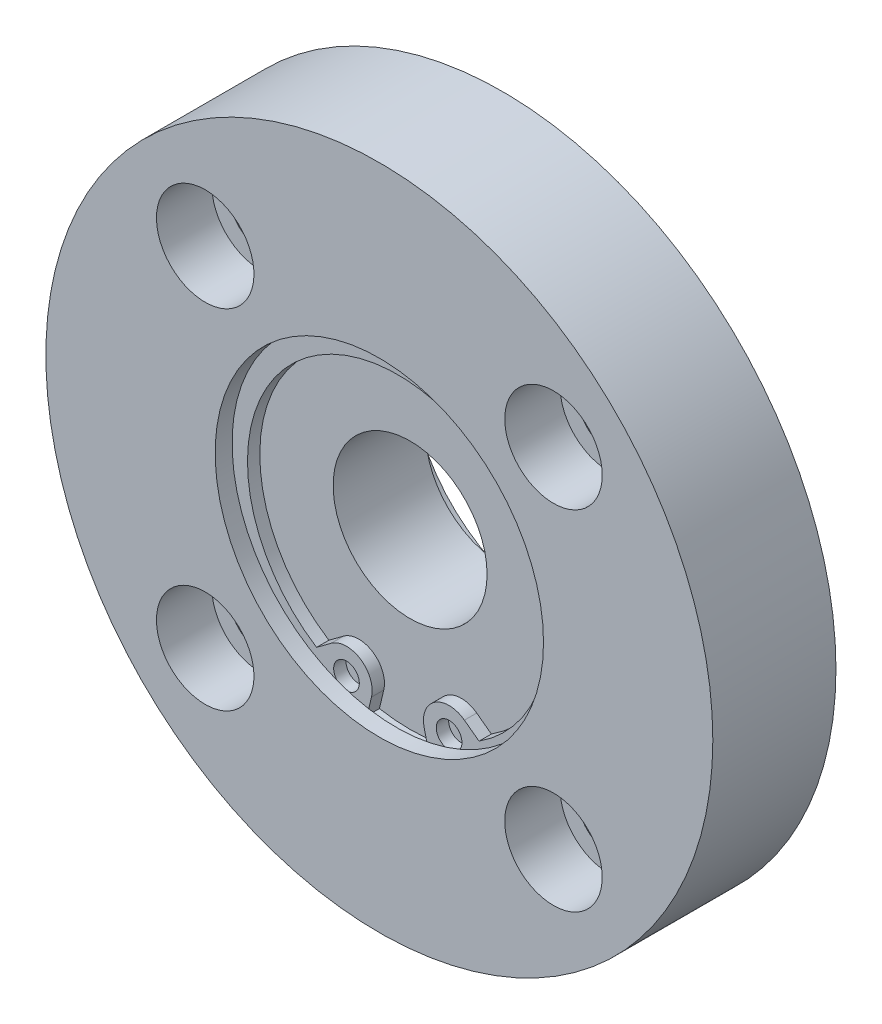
ISO-10303-21;
HEADER;
FILE_DESCRIPTION(('STEP AP214'),'2;1');
FILE_NAME('part.step','',(''),(''),'','','');
FILE_SCHEMA(('AUTOMOTIVE_DESIGN { 1 0 10303 214 1 1 1 1 }'));
ENDSEC;
DATA;
#1=APPLICATION_CONTEXT('core data for automotive mechanical design processes');
#2=APPLICATION_PROTOCOL_DEFINITION('international standard','automotive_design',2000,#1);
#3=PRODUCT_CONTEXT('',#1,'mechanical');
#4=PRODUCT('Part','Part','',(#3));
#5=PRODUCT_RELATED_PRODUCT_CATEGORY('part','',(#4));
#6=PRODUCT_DEFINITION_FORMATION('','',#4);
#7=PRODUCT_DEFINITION_CONTEXT('part definition',#1,'design');
#8=PRODUCT_DEFINITION('design','',#6,#7);
#9=PRODUCT_DEFINITION_SHAPE('','',#8);
#10=(LENGTH_UNIT() NAMED_UNIT(*) SI_UNIT(.MILLI.,.METRE.));
#11=(NAMED_UNIT(*) PLANE_ANGLE_UNIT() SI_UNIT($,.RADIAN.));
#12=(NAMED_UNIT(*) SI_UNIT($,.STERADIAN.) SOLID_ANGLE_UNIT());
#13=UNCERTAINTY_MEASURE_WITH_UNIT(LENGTH_MEASURE(1.E-05),#10,'distance_accuracy_value','');
#14=(GEOMETRIC_REPRESENTATION_CONTEXT(3) GLOBAL_UNCERTAINTY_ASSIGNED_CONTEXT((#13)) GLOBAL_UNIT_ASSIGNED_CONTEXT((#10,
#11,#12)) REPRESENTATION_CONTEXT('',''));
#15=CARTESIAN_POINT('',(0.,0.,0.));
#16=DIRECTION('',(0.,0.,1.));
#17=DIRECTION('',(1.,0.,0.));
#18=AXIS2_PLACEMENT_3D('',#15,#16,#17);
#19=CARTESIAN_POINT('',(16.9705627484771,16.9705627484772,0.));
#20=DIRECTION('',(0.,0.,1.));
#21=DIRECTION('',(1.,0.,0.));
#22=AXIS2_PLACEMENT_3D('',#19,#20,#21);
#23=CYLINDRICAL_SURFACE('',#22,3.);
#24=CARTESIAN_POINT('',(16.9705627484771,16.9705627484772,0.));
#25=DIRECTION('',(0.,0.,1.));
#26=DIRECTION('',(1.,0.,0.));
#27=AXIS2_PLACEMENT_3D('',#24,#25,#26);
#28=CIRCLE('',#27,3.);
#29=CARTESIAN_POINT('',(19.970562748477,16.9705627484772,0.));
#30=VERTEX_POINT('',#29);
#31=EDGE_CURVE('E226',#30,#30,#28,.T.);
#32=ORIENTED_EDGE('',*,*,#31,.F.);
#33=EDGE_LOOP('',(#32));
#34=FACE_BOUND('',#33,.T.);
#35=CARTESIAN_POINT('',(16.9705627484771,16.9705627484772,6.6));
#36=DIRECTION('',(0.,0.,1.));
#37=DIRECTION('',(1.,0.,0.));
#38=AXIS2_PLACEMENT_3D('',#35,#36,#37);
#39=CIRCLE('',#38,3.);
#40=CARTESIAN_POINT('',(19.970562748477,16.9705627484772,6.6));
#41=VERTEX_POINT('',#40);
#42=EDGE_CURVE('E225',#41,#41,#39,.F.);
#43=ORIENTED_EDGE('',*,*,#42,.F.);
#44=EDGE_LOOP('',(#43));
#45=FACE_BOUND('',#44,.T.);
#46=ADVANCED_FACE('F14',(#34,#45),#23,.F.);
#47=CARTESIAN_POINT('',(16.9705627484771,-16.9705627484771,0.));
#48=DIRECTION('',(0.,0.,1.));
#49=DIRECTION('',(1.,0.,0.));
#50=AXIS2_PLACEMENT_3D('',#47,#48,#49);
#51=CYLINDRICAL_SURFACE('',#50,3.);
#52=CARTESIAN_POINT('',(16.9705627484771,-16.9705627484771,0.));
#53=DIRECTION('',(0.,0.,1.));
#54=DIRECTION('',(0.,-1.,0.));
#55=AXIS2_PLACEMENT_3D('',#52,#53,#54);
#56=CIRCLE('',#55,3.);
#57=CARTESIAN_POINT('',(16.9705627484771,-19.9705627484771,0.));
#58=VERTEX_POINT('',#57);
#59=EDGE_CURVE('E216',#58,#58,#56,.T.);
#60=ORIENTED_EDGE('',*,*,#59,.F.);
#61=EDGE_LOOP('',(#60));
#62=FACE_BOUND('',#61,.T.);
#63=CARTESIAN_POINT('',(16.9705627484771,-16.9705627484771,6.6));
#64=DIRECTION('',(0.,0.,1.));
#65=DIRECTION('',(1.,0.,0.));
#66=AXIS2_PLACEMENT_3D('',#63,#64,#65);
#67=CIRCLE('',#66,3.);
#68=CARTESIAN_POINT('',(19.9705627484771,-16.9705627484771,6.6));
#69=VERTEX_POINT('',#68);
#70=EDGE_CURVE('E209',#69,#69,#67,.F.);
#71=ORIENTED_EDGE('',*,*,#70,.F.);
#72=EDGE_LOOP('',(#71));
#73=FACE_BOUND('',#72,.T.);
#74=ADVANCED_FACE('F326',(#62,#73),#51,.F.);
#75=CARTESIAN_POINT('',(-16.9705627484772,-16.9705627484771,0.));
#76=DIRECTION('',(0.,0.,1.));
#77=DIRECTION('',(1.,0.,0.));
#78=AXIS2_PLACEMENT_3D('',#75,#76,#77);
#79=CYLINDRICAL_SURFACE('',#78,3.);
#80=CARTESIAN_POINT('',(-16.9705627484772,-16.9705627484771,0.));
#81=DIRECTION('',(0.,0.,1.));
#82=DIRECTION('',(-1.,0.,0.));
#83=AXIS2_PLACEMENT_3D('',#80,#81,#82);
#84=CIRCLE('',#83,3.);
#85=CARTESIAN_POINT('',(-19.9705627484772,-16.9705627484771,0.));
#86=VERTEX_POINT('',#85);
#87=EDGE_CURVE('E213',#86,#86,#84,.T.);
#88=ORIENTED_EDGE('',*,*,#87,.F.);
#89=EDGE_LOOP('',(#88));
#90=FACE_BOUND('',#89,.T.);
#91=CARTESIAN_POINT('',(-16.9705627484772,-16.9705627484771,6.6));
#92=DIRECTION('',(0.,0.,1.));
#93=DIRECTION('',(1.,0.,0.));
#94=AXIS2_PLACEMENT_3D('',#91,#92,#93);
#95=CIRCLE('',#94,3.);
#96=CARTESIAN_POINT('',(-13.9705627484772,-16.9705627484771,6.6));
#97=VERTEX_POINT('',#96);
#98=EDGE_CURVE('E202',#97,#97,#95,.F.);
#99=ORIENTED_EDGE('',*,*,#98,.F.);
#100=EDGE_LOOP('',(#99));
#101=FACE_BOUND('',#100,.T.);
#102=ADVANCED_FACE('F332',(#90,#101),#79,.F.);
#103=CARTESIAN_POINT('',(-16.9705627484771,16.9705627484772,0.));
#104=DIRECTION('',(0.,0.,1.));
#105=DIRECTION('',(1.,0.,0.));
#106=AXIS2_PLACEMENT_3D('',#103,#104,#105);
#107=CYLINDRICAL_SURFACE('',#106,3.);
#108=CARTESIAN_POINT('',(-16.9705627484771,16.9705627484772,0.));
#109=DIRECTION('',(0.,0.,1.));
#110=DIRECTION('',(0.,1.,0.));
#111=AXIS2_PLACEMENT_3D('',#108,#109,#110);
#112=CIRCLE('',#111,3.);
#113=CARTESIAN_POINT('',(-16.970562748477,19.9705627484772,0.));
#114=VERTEX_POINT('',#113);
#115=EDGE_CURVE('E210',#114,#114,#112,.T.);
#116=ORIENTED_EDGE('',*,*,#115,.F.);
#117=EDGE_LOOP('',(#116));
#118=FACE_BOUND('',#117,.T.);
#119=CARTESIAN_POINT('',(-16.9705627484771,16.9705627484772,6.6));
#120=DIRECTION('',(0.,0.,1.));
#121=DIRECTION('',(1.,0.,0.));
#122=AXIS2_PLACEMENT_3D('',#119,#120,#121);
#123=CIRCLE('',#122,3.);
#124=CARTESIAN_POINT('',(-13.9705627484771,16.9705627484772,6.6));
#125=VERTEX_POINT('',#124);
#126=EDGE_CURVE('E195',#125,#125,#123,.F.);
#127=ORIENTED_EDGE('',*,*,#126,.F.);
#128=EDGE_LOOP('',(#127));
#129=FACE_BOUND('',#128,.T.);
#130=ADVANCED_FACE('F474',(#118,#129),#107,.F.);
#131=CARTESIAN_POINT('',(0.,0.,-5.));
#132=DIRECTION('',(0.,0.,1.));
#133=DIRECTION('',(1.,0.,0.));
#134=AXIS2_PLACEMENT_3D('',#131,#132,#133);
#135=CYLINDRICAL_SURFACE('',#134,19.);
#136=CARTESIAN_POINT('',(0.,0.,-5.));
#137=DIRECTION('',(0.,0.,-1.));
#138=DIRECTION('',(-1.,0.,0.));
#139=AXIS2_PLACEMENT_3D('',#136,#137,#138);
#140=CIRCLE('',#139,19.);
#141=CARTESIAN_POINT('',(-19.,0.,-5.));
#142=VERTEX_POINT('',#141);
#143=EDGE_CURVE('E177',#142,#142,#140,.T.);
#144=ORIENTED_EDGE('',*,*,#143,.F.);
#145=EDGE_LOOP('',(#144));
#146=FACE_BOUND('',#145,.T.);
#147=CARTESIAN_POINT('',(0.,0.,0.));
#148=DIRECTION('',(0.,0.,-1.));
#149=DIRECTION('',(-1.,0.,0.));
#150=AXIS2_PLACEMENT_3D('',#147,#148,#149);
#151=CIRCLE('',#150,19.);
#152=CARTESIAN_POINT('',(-19.,0.,0.));
#153=VERTEX_POINT('',#152);
#154=EDGE_CURVE('E178',#153,#153,#151,.T.);
#155=ORIENTED_EDGE('',*,*,#154,.T.);
#156=EDGE_LOOP('',(#155));
#157=FACE_BOUND('',#156,.T.);
#158=ADVANCED_FACE('F469',(#146,#157),#135,.T.);
#159=CARTESIAN_POINT('',(0.,0.,0.));
#160=DIRECTION('',(0.,0.,1.));
#161=DIRECTION('',(1.,0.,0.));
#162=AXIS2_PLACEMENT_3D('',#159,#160,#161);
#163=PLANE('',#162);
#164=ORIENTED_EDGE('',*,*,#115,.T.);
#165=EDGE_LOOP('',(#164));
#166=FACE_BOUND('',#165,.T.);
#167=ORIENTED_EDGE('',*,*,#87,.T.);
#168=EDGE_LOOP('',(#167));
#169=FACE_BOUND('',#168,.T.);
#170=ORIENTED_EDGE('',*,*,#59,.T.);
#171=EDGE_LOOP('',(#170));
#172=FACE_BOUND('',#171,.T.);
#173=ORIENTED_EDGE('',*,*,#31,.T.);
#174=EDGE_LOOP('',(#173));
#175=FACE_BOUND('',#174,.T.);
#176=CARTESIAN_POINT('',(0.,0.,0.));
#177=DIRECTION('',(0.,0.,1.));
#178=DIRECTION('',(1.,0.,0.));
#179=AXIS2_PLACEMENT_3D('',#176,#177,#178);
#180=CIRCLE('',#179,32.5);
#181=CARTESIAN_POINT('',(32.5,0.,0.));
#182=VERTEX_POINT('',#181);
#183=EDGE_CURVE('E232',#182,#182,#180,.T.);
#184=ORIENTED_EDGE('',*,*,#183,.F.);
#185=EDGE_LOOP('',(#184));
#186=FACE_BOUND('',#185,.T.);
#187=ORIENTED_EDGE('',*,*,#154,.F.);
#188=EDGE_LOOP('',(#187));
#189=FACE_BOUND('',#188,.T.);
#190=ADVANCED_FACE('F351',(#166,#169,#172,#175,#186,#189),#163,.F.);
#191=CARTESIAN_POINT('',(16.9705627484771,16.9705627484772,6.6));
#192=DIRECTION('',(0.,0.,1.));
#193=DIRECTION('',(1.,0.,0.));
#194=AXIS2_PLACEMENT_3D('',#191,#192,#193);
#195=PLANE('',#194);
#196=CARTESIAN_POINT('',(16.9705627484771,16.9705627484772,6.6));
#197=DIRECTION('',(0.,0.,1.));
#198=DIRECTION('',(1.,0.,0.));
#199=AXIS2_PLACEMENT_3D('',#196,#197,#198);
#200=CIRCLE('',#199,4.75);
#201=CARTESIAN_POINT('',(21.7205627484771,16.9705627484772,6.6));
#202=VERTEX_POINT('',#201);
#203=EDGE_CURVE('E222',#202,#202,#200,.T.);
#204=ORIENTED_EDGE('',*,*,#203,.T.);
#205=EDGE_LOOP('',(#204));
#206=FACE_BOUND('',#205,.T.);
#207=ORIENTED_EDGE('',*,*,#42,.T.);
#208=EDGE_LOOP('',(#207));
#209=FACE_BOUND('',#208,.T.);
#210=ADVANCED_FACE('F553',(#206,#209),#195,.T.);
#211=CARTESIAN_POINT('',(16.9705627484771,-16.9705627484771,6.6));
#212=DIRECTION('',(0.,0.,1.));
#213=DIRECTION('',(0.,-1.,0.));
#214=AXIS2_PLACEMENT_3D('',#211,#212,#213);
#215=PLANE('',#214);
#216=CARTESIAN_POINT('',(16.9705627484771,-16.9705627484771,6.6));
#217=DIRECTION('',(0.,0.,1.));
#218=DIRECTION('',(0.,-1.,0.));
#219=AXIS2_PLACEMENT_3D('',#216,#217,#218);
#220=CIRCLE('',#219,4.75);
#221=CARTESIAN_POINT('',(16.9705627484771,-21.7205627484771,6.6));
#222=VERTEX_POINT('',#221);
#223=EDGE_CURVE('E206',#222,#222,#220,.T.);
#224=ORIENTED_EDGE('',*,*,#223,.T.);
#225=EDGE_LOOP('',(#224));
#226=FACE_BOUND('',#225,.T.);
#227=ORIENTED_EDGE('',*,*,#70,.T.);
#228=EDGE_LOOP('',(#227));
#229=FACE_BOUND('',#228,.T.);
#230=ADVANCED_FACE('F514',(#226,#229),#215,.T.);
#231=CARTESIAN_POINT('',(-16.9705627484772,-16.9705627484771,6.6));
#232=DIRECTION('',(0.,0.,1.));
#233=DIRECTION('',(-1.,0.,0.));
#234=AXIS2_PLACEMENT_3D('',#231,#232,#233);
#235=PLANE('',#234);
#236=CARTESIAN_POINT('',(-16.9705627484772,-16.9705627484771,6.6));
#237=DIRECTION('',(0.,0.,1.));
#238=DIRECTION('',(-1.,0.,0.));
#239=AXIS2_PLACEMENT_3D('',#236,#237,#238);
#240=CIRCLE('',#239,4.75);
#241=CARTESIAN_POINT('',(-21.7205627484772,-16.9705627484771,6.6));
#242=VERTEX_POINT('',#241);
#243=EDGE_CURVE('E199',#242,#242,#240,.T.);
#244=ORIENTED_EDGE('',*,*,#243,.T.);
#245=EDGE_LOOP('',(#244));
#246=FACE_BOUND('',#245,.T.);
#247=ORIENTED_EDGE('',*,*,#98,.T.);
#248=EDGE_LOOP('',(#247));
#249=FACE_BOUND('',#248,.T.);
#250=ADVANCED_FACE('F493',(#246,#249),#235,.T.);
#251=CARTESIAN_POINT('',(-16.9705627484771,16.9705627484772,6.6));
#252=DIRECTION('',(0.,0.,1.));
#253=DIRECTION('',(0.,1.,0.));
#254=AXIS2_PLACEMENT_3D('',#251,#252,#253);
#255=PLANE('',#254);
#256=CARTESIAN_POINT('',(-16.9705627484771,16.9705627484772,6.6));
#257=DIRECTION('',(0.,0.,1.));
#258=DIRECTION('',(0.,1.,0.));
#259=AXIS2_PLACEMENT_3D('',#256,#257,#258);
#260=CIRCLE('',#259,4.75);
#261=CARTESIAN_POINT('',(-16.970562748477,21.7205627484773,6.6));
#262=VERTEX_POINT('',#261);
#263=EDGE_CURVE('E192',#262,#262,#260,.T.);
#264=ORIENTED_EDGE('',*,*,#263,.T.);
#265=EDGE_LOOP('',(#264));
#266=FACE_BOUND('',#265,.T.);
#267=ORIENTED_EDGE('',*,*,#126,.T.);
#268=EDGE_LOOP('',(#267));
#269=FACE_BOUND('',#268,.T.);
#270=ADVANCED_FACE('F462',(#266,#269),#255,.T.);
#271=CARTESIAN_POINT('',(0.,0.,-5.));
#272=DIRECTION('',(0.,0.,-1.));
#273=DIRECTION('',(-1.,0.,0.));
#274=AXIS2_PLACEMENT_3D('',#271,#272,#273);
#275=PLANE('',#274);
#276=ORIENTED_EDGE('',*,*,#143,.T.);
#277=EDGE_LOOP('',(#276));
#278=FACE_BOUND('',#277,.T.);
#279=CARTESIAN_POINT('',(0.,0.,-5.));
#280=DIRECTION('',(0.,0.,-1.));
#281=DIRECTION('',(-1.,0.,0.));
#282=AXIS2_PLACEMENT_3D('',#279,#280,#281);
#283=CIRCLE('',#282,14.);
#284=CARTESIAN_POINT('',(-14.,0.,-5.));
#285=VERTEX_POINT('',#284);
#286=EDGE_CURVE('E174',#285,#285,#283,.T.);
#287=ORIENTED_EDGE('',*,*,#286,.F.);
#288=EDGE_LOOP('',(#287));
#289=FACE_BOUND('',#288,.T.);
#290=ADVANCED_FACE('F359',(#278,#289),#275,.T.);
#291=CARTESIAN_POINT('',(0.,0.,12.));
#292=DIRECTION('',(0.,0.,-1.));
#293=DIRECTION('',(-1.,0.,0.));
#294=AXIS2_PLACEMENT_3D('',#291,#292,#293);
#295=CYLINDRICAL_SURFACE('',#294,32.5);
#296=CARTESIAN_POINT('',(0.,0.,12.));
#297=DIRECTION('',(0.,0.,1.));
#298=DIRECTION('',(1.,0.,0.));
#299=AXIS2_PLACEMENT_3D('',#296,#297,#298);
#300=CIRCLE('',#299,32.5);
#301=CARTESIAN_POINT('',(32.5,0.,12.));
#302=VERTEX_POINT('',#301);
#303=EDGE_CURVE('E182',#302,#302,#300,.T.);
#304=ORIENTED_EDGE('',*,*,#303,.F.);
#305=EDGE_LOOP('',(#304));
#306=FACE_BOUND('',#305,.T.);
#307=ORIENTED_EDGE('',*,*,#183,.T.);
#308=EDGE_LOOP('',(#307));
#309=FACE_BOUND('',#308,.T.);
#310=ADVANCED_FACE('F356',(#306,#309),#295,.T.);
#311=CARTESIAN_POINT('',(16.9705627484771,16.9705627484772,6.6));
#312=DIRECTION('',(0.,0.,1.));
#313=DIRECTION('',(1.,0.,0.));
#314=AXIS2_PLACEMENT_3D('',#311,#312,#313);
#315=CYLINDRICAL_SURFACE('',#314,4.75);
#316=ORIENTED_EDGE('',*,*,#203,.F.);
#317=EDGE_LOOP('',(#316));
#318=FACE_BOUND('',#317,.T.);
#319=CARTESIAN_POINT('',(16.9705627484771,16.9705627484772,12.));
#320=DIRECTION('',(0.,0.,1.));
#321=DIRECTION('',(1.,0.,0.));
#322=AXIS2_PLACEMENT_3D('',#319,#320,#321);
#323=CIRCLE('',#322,4.75);
#324=CARTESIAN_POINT('',(21.7205627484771,16.9705627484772,12.));
#325=VERTEX_POINT('',#324);
#326=EDGE_CURVE('E219',#325,#325,#323,.T.);
#327=ORIENTED_EDGE('',*,*,#326,.T.);
#328=EDGE_LOOP('',(#327));
#329=FACE_BOUND('',#328,.T.);
#330=ADVANCED_FACE('F339',(#318,#329),#315,.F.);
#331=CARTESIAN_POINT('',(16.9705627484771,-16.9705627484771,6.6));
#332=DIRECTION('',(0.,0.,1.));
#333=DIRECTION('',(1.,0.,0.));
#334=AXIS2_PLACEMENT_3D('',#331,#332,#333);
#335=CYLINDRICAL_SURFACE('',#334,4.75);
#336=ORIENTED_EDGE('',*,*,#223,.F.);
#337=EDGE_LOOP('',(#336));
#338=FACE_BOUND('',#337,.T.);
#339=CARTESIAN_POINT('',(16.9705627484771,-16.9705627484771,12.));
#340=DIRECTION('',(0.,0.,1.));
#341=DIRECTION('',(0.,-1.,0.));
#342=AXIS2_PLACEMENT_3D('',#339,#340,#341);
#343=CIRCLE('',#342,4.75);
#344=CARTESIAN_POINT('',(16.9705627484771,-21.7205627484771,12.));
#345=VERTEX_POINT('',#344);
#346=EDGE_CURVE('E203',#345,#345,#343,.T.);
#347=ORIENTED_EDGE('',*,*,#346,.T.);
#348=EDGE_LOOP('',(#347));
#349=FACE_BOUND('',#348,.T.);
#350=ADVANCED_FACE('F523',(#338,#349),#335,.F.);
#351=CARTESIAN_POINT('',(-16.9705627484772,-16.9705627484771,6.6));
#352=DIRECTION('',(0.,0.,1.));
#353=DIRECTION('',(1.,0.,0.));
#354=AXIS2_PLACEMENT_3D('',#351,#352,#353);
#355=CYLINDRICAL_SURFACE('',#354,4.75);
#356=ORIENTED_EDGE('',*,*,#243,.F.);
#357=EDGE_LOOP('',(#356));
#358=FACE_BOUND('',#357,.T.);
#359=CARTESIAN_POINT('',(-16.9705627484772,-16.9705627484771,12.));
#360=DIRECTION('',(0.,0.,1.));
#361=DIRECTION('',(-1.,0.,0.));
#362=AXIS2_PLACEMENT_3D('',#359,#360,#361);
#363=CIRCLE('',#362,4.75);
#364=CARTESIAN_POINT('',(-21.7205627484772,-16.9705627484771,12.));
#365=VERTEX_POINT('',#364);
#366=EDGE_CURVE('E196',#365,#365,#363,.T.);
#367=ORIENTED_EDGE('',*,*,#366,.T.);
#368=EDGE_LOOP('',(#367));
#369=FACE_BOUND('',#368,.T.);
#370=ADVANCED_FACE('F504',(#358,#369),#355,.F.);
#371=CARTESIAN_POINT('',(-16.9705627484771,16.9705627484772,6.6));
#372=DIRECTION('',(0.,0.,1.));
#373=DIRECTION('',(1.,0.,0.));
#374=AXIS2_PLACEMENT_3D('',#371,#372,#373);
#375=CYLINDRICAL_SURFACE('',#374,4.75);
#376=ORIENTED_EDGE('',*,*,#263,.F.);
#377=EDGE_LOOP('',(#376));
#378=FACE_BOUND('',#377,.T.);
#379=CARTESIAN_POINT('',(-16.9705627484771,16.9705627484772,12.));
#380=DIRECTION('',(0.,0.,1.));
#381=DIRECTION('',(0.,1.,0.));
#382=AXIS2_PLACEMENT_3D('',#379,#380,#381);
#383=CIRCLE('',#382,4.75);
#384=CARTESIAN_POINT('',(-16.970562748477,21.7205627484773,12.));
#385=VERTEX_POINT('',#384);
#386=EDGE_CURVE('E189',#385,#385,#383,.T.);
#387=ORIENTED_EDGE('',*,*,#386,.T.);
#388=EDGE_LOOP('',(#387));
#389=FACE_BOUND('',#388,.T.);
#390=ADVANCED_FACE('F499',(#378,#389),#375,.F.);
#391=CARTESIAN_POINT('',(0.,0.,-5.));
#392=DIRECTION('',(0.,0.,1.));
#393=DIRECTION('',(1.,0.,0.));
#394=AXIS2_PLACEMENT_3D('',#391,#392,#393);
#395=CYLINDRICAL_SURFACE('',#394,14.);
#396=ORIENTED_EDGE('',*,*,#286,.T.);
#397=EDGE_LOOP('',(#396));
#398=FACE_BOUND('',#397,.T.);
#399=CARTESIAN_POINT('',(0.,0.,0.));
#400=DIRECTION('',(0.,0.,-1.));
#401=DIRECTION('',(-1.,0.,0.));
#402=AXIS2_PLACEMENT_3D('',#399,#400,#401);
#403=CIRCLE('',#402,14.);
#404=CARTESIAN_POINT('',(-14.,0.,0.));
#405=VERTEX_POINT('',#404);
#406=EDGE_CURVE('E171',#405,#405,#403,.T.);
#407=ORIENTED_EDGE('',*,*,#406,.F.);
#408=EDGE_LOOP('',(#407));
#409=FACE_BOUND('',#408,.T.);
#410=ADVANCED_FACE('F354',(#398,#409),#395,.F.);
#411=CARTESIAN_POINT('',(0.,0.,12.));
#412=DIRECTION('',(0.,0.,1.));
#413=DIRECTION('',(1.,0.,0.));
#414=AXIS2_PLACEMENT_3D('',#411,#412,#413);
#415=PLANE('',#414);
#416=CARTESIAN_POINT('',(0.,0.,12.));
#417=DIRECTION('',(0.,0.,1.));
#418=DIRECTION('',(1.,0.,0.));
#419=AXIS2_PLACEMENT_3D('',#416,#417,#418);
#420=CIRCLE('',#419,16.);
#421=CARTESIAN_POINT('',(16.,0.,12.));
#422=VERTEX_POINT('',#421);
#423=EDGE_CURVE('E185',#422,#422,#420,.T.);
#424=ORIENTED_EDGE('',*,*,#423,.F.);
#425=EDGE_LOOP('',(#424));
#426=FACE_BOUND('',#425,.T.);
#427=ORIENTED_EDGE('',*,*,#386,.F.);
#428=EDGE_LOOP('',(#427));
#429=FACE_BOUND('',#428,.T.);
#430=ORIENTED_EDGE('',*,*,#366,.F.);
#431=EDGE_LOOP('',(#430));
#432=FACE_BOUND('',#431,.T.);
#433=ORIENTED_EDGE('',*,*,#346,.F.);
#434=EDGE_LOOP('',(#433));
#435=FACE_BOUND('',#434,.T.);
#436=ORIENTED_EDGE('',*,*,#326,.F.);
#437=EDGE_LOOP('',(#436));
#438=FACE_BOUND('',#437,.T.);
#439=ORIENTED_EDGE('',*,*,#303,.T.);
#440=EDGE_LOOP('',(#439));
#441=FACE_BOUND('',#440,.T.);
#442=ADVANCED_FACE('F349',(#426,#429,#432,#435,#438,#441),#415,.T.);
#443=ORIENTED_EDGE('',*,*,#406,.T.);
#444=EDGE_LOOP('',(#443));
#445=FACE_BOUND('',#444,.T.);
#446=CARTESIAN_POINT('',(0.,0.,0.));
#447=DIRECTION('',(0.,0.,1.));
#448=DIRECTION('',(1.,0.,0.));
#449=AXIS2_PLACEMENT_3D('',#446,#447,#448);
#450=CIRCLE('',#449,7.5);
#451=CARTESIAN_POINT('',(7.5,0.,0.));
#452=VERTEX_POINT('',#451);
#453=EDGE_CURVE('E229',#452,#452,#450,.T.);
#454=ORIENTED_EDGE('',*,*,#453,.T.);
#455=EDGE_LOOP('',(#454));
#456=FACE_BOUND('',#455,.T.);
#457=ADVANCED_FACE('F346',(#445,#456),#163,.F.);
#458=CARTESIAN_POINT('',(0.,0.,9.));
#459=DIRECTION('',(0.,0.,1.));
#460=DIRECTION('',(1.,0.,0.));
#461=AXIS2_PLACEMENT_3D('',#458,#459,#460);
#462=CYLINDRICAL_SURFACE('',#461,16.);
#463=CARTESIAN_POINT('',(0.,0.,10.35));
#464=DIRECTION('',(0.,0.,1.));
#465=DIRECTION('',(1.,0.,0.));
#466=AXIS2_PLACEMENT_3D('',#463,#464,#465);
#467=CIRCLE('',#466,16.);
#468=CARTESIAN_POINT('',(16.,0.,10.35));
#469=VERTEX_POINT('',#468);
#470=EDGE_CURVE('E168',#469,#469,#467,.F.);
#471=ORIENTED_EDGE('',*,*,#470,.T.);
#472=EDGE_LOOP('',(#471));
#473=FACE_BOUND('',#472,.T.);
#474=ORIENTED_EDGE('',*,*,#423,.T.);
#475=EDGE_LOOP('',(#474));
#476=FACE_BOUND('',#475,.T.);
#477=ADVANCED_FACE('F344',(#473,#476),#462,.F.);
#478=CARTESIAN_POINT('',(0.,0.,12.));
#479=DIRECTION('',(0.,0.,-1.));
#480=DIRECTION('',(-1.,0.,0.));
#481=AXIS2_PLACEMENT_3D('',#478,#479,#480);
#482=CYLINDRICAL_SURFACE('',#481,7.5);
#483=ORIENTED_EDGE('',*,*,#453,.F.);
#484=EDGE_LOOP('',(#483));
#485=FACE_BOUND('',#484,.T.);
#486=CARTESIAN_POINT('',(0.,0.,9.));
#487=DIRECTION('',(0.,0.,1.));
#488=DIRECTION('',(1.,0.,0.));
#489=AXIS2_PLACEMENT_3D('',#486,#487,#488);
#490=CIRCLE('',#489,7.5);
#491=CARTESIAN_POINT('',(7.5,0.,9.));
#492=VERTEX_POINT('',#491);
#493=EDGE_CURVE('E188',#492,#492,#490,.T.);
#494=ORIENTED_EDGE('',*,*,#493,.T.);
#495=EDGE_LOOP('',(#494));
#496=FACE_BOUND('',#495,.T.);
#497=ADVANCED_FACE('F341',(#485,#496),#482,.F.);
#498=CARTESIAN_POINT('',(0.,0.,9.));
#499=DIRECTION('',(0.,0.,1.));
#500=DIRECTION('',(1.,0.,0.));
#501=AXIS2_PLACEMENT_3D('',#498,#499,#500);
#502=PLANE('',#501);
#503=ORIENTED_EDGE('',*,*,#493,.F.);
#504=EDGE_LOOP('',(#503));
#505=FACE_BOUND('',#504,.T.);
#506=CARTESIAN_POINT('',(0.,0.,9.));
#507=DIRECTION('',(0.,0.,1.));
#508=DIRECTION('',(1.,0.,0.));
#509=AXIS2_PLACEMENT_3D('',#506,#507,#508);
#510=CIRCLE('',#509,16.85);
#511=CARTESIAN_POINT('',(-2.99125499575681,-16.5823669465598,9.));
#512=VERTEX_POINT('',#511);
#513=CARTESIAN_POINT('',(2.99125499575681,-16.5823669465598,9.));
#514=VERTEX_POINT('',#513);
#515=EDGE_CURVE('E153',#512,#514,#510,.T.);
#516=ORIENTED_EDGE('',*,*,#515,.T.);
#517=DIRECTION('',(-0.231349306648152,0.972870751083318,0.));
#518=VECTOR('',#517,1.);
#519=CARTESIAN_POINT('',(-0.901087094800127,-0.214279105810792,9.));
#520=LINE('',#519,#518);
#521=CARTESIAN_POINT('',(2.56782312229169,-14.8017500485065,9.));
#522=VERTEX_POINT('',#521);
#523=EDGE_CURVE('E9',#514,#522,#520,.T.);
#524=ORIENTED_EDGE('',*,*,#523,.T.);
#525=CARTESIAN_POINT('',(5.,-14.2233767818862,9.));
#526=DIRECTION('',(0.,0.,1.));
#527=DIRECTION('',(1.,0.,0.));
#528=AXIS2_PLACEMENT_3D('',#525,#526,#527);
#529=CIRCLE('',#528,2.5);
#530=CARTESIAN_POINT('',(6.49138441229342,-12.2169439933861,9.));
#531=VERTEX_POINT('',#530);
#532=EDGE_CURVE('E25',#531,#522,#529,.T.);
#533=ORIENTED_EDGE('',*,*,#532,.F.);
#534=DIRECTION('',(0.802573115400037,-0.596553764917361,0.));
#535=VECTOR('',#534,1.);
#536=CARTESIAN_POINT('',(-3.53907369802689,-4.76128987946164,9.));
#537=LINE('',#536,#535);
#538=CARTESIAN_POINT('',(7.91695293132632,-13.2765711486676,9.));
#539=VERTEX_POINT('',#538);
#540=EDGE_CURVE('E72',#531,#539,#537,.T.);
#541=ORIENTED_EDGE('',*,*,#540,.T.);
#542=CARTESIAN_POINT('',(0.,-0.95,9.));
#543=DIRECTION('',(0.,0.,1.));
#544=DIRECTION('',(1.,0.,0.));
#545=AXIS2_PLACEMENT_3D('',#542,#543,#544);
#546=CIRCLE('',#545,14.65);
#547=CARTESIAN_POINT('',(-7.91695293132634,-13.2765711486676,9.));
#548=VERTEX_POINT('',#547);
#549=EDGE_CURVE('E274',#539,#548,#546,.T.);
#550=ORIENTED_EDGE('',*,*,#549,.T.);
#551=DIRECTION('',(0.802573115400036,0.596553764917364,0.));
#552=VECTOR('',#551,1.);
#553=CARTESIAN_POINT('',(3.53907369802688,-4.7612898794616,9.));
#554=LINE('',#553,#552);
#555=CARTESIAN_POINT('',(-6.49138441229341,-12.2169439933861,9.));
#556=VERTEX_POINT('',#555);
#557=EDGE_CURVE('E270',#548,#556,#554,.T.);
#558=ORIENTED_EDGE('',*,*,#557,.T.);
#559=CARTESIAN_POINT('',(-5.,-14.2233767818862,9.));
#560=DIRECTION('',(0.,0.,1.));
#561=DIRECTION('',(1.,0.,0.));
#562=AXIS2_PLACEMENT_3D('',#559,#560,#561);
#563=CIRCLE('',#562,2.5);
#564=CARTESIAN_POINT('',(-2.56782312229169,-14.8017500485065,9.));
#565=VERTEX_POINT('',#564);
#566=EDGE_CURVE('E265',#565,#556,#563,.T.);
#567=ORIENTED_EDGE('',*,*,#566,.F.);
#568=DIRECTION('',(-0.231349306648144,-0.97287075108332,0.));
#569=VECTOR('',#568,1.);
#570=CARTESIAN_POINT('',(0.901087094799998,-0.214279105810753,9.));
#571=LINE('',#570,#569);
#572=EDGE_CURVE('E268',#565,#512,#571,.T.);
#573=ORIENTED_EDGE('',*,*,#572,.T.);
#574=EDGE_LOOP('',(#516,#524,#533,#541,#550,#558,#567,#573));
#575=FACE_BOUND('',#574,.T.);
#576=ADVANCED_FACE('F309',(#505,#575),#502,.T.);
#577=CARTESIAN_POINT('',(0.,0.,10.35));
#578=DIRECTION('',(0.,0.,1.));
#579=DIRECTION('',(1.,0.,0.));
#580=AXIS2_PLACEMENT_3D('',#577,#578,#579);
#581=PLANE('',#580);
#582=CARTESIAN_POINT('',(0.,0.,10.35));
#583=DIRECTION('',(0.,0.,1.));
#584=DIRECTION('',(1.,0.,0.));
#585=AXIS2_PLACEMENT_3D('',#582,#583,#584);
#586=CIRCLE('',#585,16.85);
#587=CARTESIAN_POINT('',(16.85,0.,10.35));
#588=VERTEX_POINT('',#587);
#589=EDGE_CURVE('E161',#588,#588,#586,.T.);
#590=ORIENTED_EDGE('',*,*,#589,.F.);
#591=EDGE_LOOP('',(#590));
#592=FACE_BOUND('',#591,.T.);
#593=ORIENTED_EDGE('',*,*,#470,.F.);
#594=EDGE_LOOP('',(#593));
#595=FACE_BOUND('',#594,.T.);
#596=ADVANCED_FACE('F444',(#592,#595),#581,.F.);
#597=CARTESIAN_POINT('',(0.,0.,10.35));
#598=DIRECTION('',(0.,0.,-1.));
#599=DIRECTION('',(-1.,0.,0.));
#600=AXIS2_PLACEMENT_3D('',#597,#598,#599);
#601=CYLINDRICAL_SURFACE('',#600,16.85);
#602=ORIENTED_EDGE('',*,*,#589,.T.);
#603=EDGE_LOOP('',(#602));
#604=FACE_BOUND('',#603,.T.);
#605=CARTESIAN_POINT('',(0.,0.,10.2));
#606=DIRECTION('',(0.,0.,-1.));
#607=DIRECTION('',(-1.,0.,0.));
#608=AXIS2_PLACEMENT_3D('',#605,#606,#607);
#609=CIRCLE('',#608,16.85);
#610=CARTESIAN_POINT('',(-2.99125499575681,-16.5823669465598,10.2));
#611=VERTEX_POINT('',#610);
#612=CARTESIAN_POINT('',(2.99125499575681,-16.5823669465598,10.2));
#613=VERTEX_POINT('',#612);
#614=EDGE_CURVE('E251',#611,#613,#609,.T.);
#615=ORIENTED_EDGE('',*,*,#614,.T.);
#616=DIRECTION('',(0.,0.,-1.));
#617=VECTOR('',#616,1.);
#618=CARTESIAN_POINT('',(2.99125499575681,-16.5823669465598,10.35));
#619=LINE('',#618,#617);
#620=EDGE_CURVE('E254',#613,#514,#619,.T.);
#621=ORIENTED_EDGE('',*,*,#620,.T.);
#622=ORIENTED_EDGE('',*,*,#515,.F.);
#623=DIRECTION('',(0.,0.,-1.));
#624=VECTOR('',#623,1.);
#625=CARTESIAN_POINT('',(-2.99125499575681,-16.5823669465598,10.35));
#626=LINE('',#625,#624);
#627=EDGE_CURVE('E181',#512,#611,#626,.F.);
#628=ORIENTED_EDGE('',*,*,#627,.T.);
#629=EDGE_LOOP('',(#615,#621,#622,#628));
#630=FACE_BOUND('',#629,.T.);
#631=ADVANCED_FACE('F310',(#604,#630),#601,.F.);
#632=CARTESIAN_POINT('',(5.,-14.2233767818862,9.));
#633=DIRECTION('',(0.,0.,1.));
#634=DIRECTION('',(1.,0.,0.));
#635=AXIS2_PLACEMENT_3D('',#632,#633,#634);
#636=CIRCLE('',#635,1.25);
#637=CARTESIAN_POINT('',(6.25,-14.2233767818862,9.));
#638=VERTEX_POINT('',#637);
#639=EDGE_CURVE('E257',#638,#638,#636,.T.);
#640=ORIENTED_EDGE('',*,*,#639,.T.);
#641=EDGE_LOOP('',(#640));
#642=FACE_BOUND('',#641,.T.);
#643=ADVANCED_FACE('F375',(#642),#502,.T.);
#644=CARTESIAN_POINT('',(-5.,-14.2233767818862,9.));
#645=DIRECTION('',(0.,0.,1.));
#646=DIRECTION('',(1.,0.,0.));
#647=AXIS2_PLACEMENT_3D('',#644,#645,#646);
#648=CIRCLE('',#647,1.25);
#649=CARTESIAN_POINT('',(-3.75,-14.2233767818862,9.));
#650=VERTEX_POINT('',#649);
#651=EDGE_CURVE('E261',#650,#650,#648,.T.);
#652=ORIENTED_EDGE('',*,*,#651,.T.);
#653=EDGE_LOOP('',(#652));
#654=FACE_BOUND('',#653,.T.);
#655=ADVANCED_FACE('F322',(#654),#502,.T.);
#656=CARTESIAN_POINT('',(6.49138441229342,-12.2169439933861,10.2));
#657=DIRECTION('',(-0.596553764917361,-0.802573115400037,0.));
#658=DIRECTION('',(-0.802573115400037,0.596553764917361,0.));
#659=AXIS2_PLACEMENT_3D('',#656,#657,#658);
#660=PLANE('',#659);
#661=ORIENTED_EDGE('',*,*,#540,.F.);
#662=DIRECTION('',(0.,0.,-1.));
#663=VECTOR('',#662,1.);
#664=CARTESIAN_POINT('',(6.49138441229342,-12.2169439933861,10.2));
#665=LINE('',#664,#663);
#666=CARTESIAN_POINT('',(6.49138441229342,-12.2169439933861,10.2));
#667=VERTEX_POINT('',#666);
#668=EDGE_CURVE('E66',#667,#531,#665,.T.);
#669=ORIENTED_EDGE('',*,*,#668,.F.);
#670=DIRECTION('',(-0.802573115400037,0.596553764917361,0.));
#671=VECTOR('',#670,1.);
#672=CARTESIAN_POINT('',(6.49138441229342,-12.2169439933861,10.2));
#673=LINE('',#672,#671);
#674=CARTESIAN_POINT('',(7.91695293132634,-13.2765711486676,10.2));
#675=VERTEX_POINT('',#674);
#676=EDGE_CURVE('E70',#675,#667,#673,.T.);
#677=ORIENTED_EDGE('',*,*,#676,.F.);
#678=DIRECTION('',(0.,0.,-1.));
#679=VECTOR('',#678,1.);
#680=CARTESIAN_POINT('',(7.91695293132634,-13.2765711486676,10.2));
#681=LINE('',#680,#679);
#682=EDGE_CURVE('E120',#675,#539,#681,.T.);
#683=ORIENTED_EDGE('',*,*,#682,.T.);
#684=EDGE_LOOP('',(#661,#669,#677,#683));
#685=FACE_BOUND('',#684,.T.);
#686=ADVANCED_FACE('F68',(#685),#660,.F.);
#687=CARTESIAN_POINT('',(0.,-0.95,10.2));
#688=DIRECTION('',(0.,0.,1.));
#689=DIRECTION('',(-1.,0.,0.));
#690=AXIS2_PLACEMENT_3D('',#687,#688,#689);
#691=CYLINDRICAL_SURFACE('',#690,14.65);
#692=ORIENTED_EDGE('',*,*,#549,.F.);
#693=ORIENTED_EDGE('',*,*,#682,.F.);
#694=CARTESIAN_POINT('',(0.,-0.95,10.2));
#695=DIRECTION('',(0.,0.,-1.));
#696=DIRECTION('',(0.,-1.,0.));
#697=AXIS2_PLACEMENT_3D('',#694,#695,#696);
#698=CIRCLE('',#697,14.65);
#699=CARTESIAN_POINT('',(-7.91695293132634,-13.2765711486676,10.2));
#700=VERTEX_POINT('',#699);
#701=EDGE_CURVE('E84',#700,#675,#698,.T.);
#702=ORIENTED_EDGE('',*,*,#701,.F.);
#703=DIRECTION('',(0.,0.,-1.));
#704=VECTOR('',#703,1.);
#705=CARTESIAN_POINT('',(-7.91695293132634,-13.2765711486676,10.2));
#706=LINE('',#705,#704);
#707=EDGE_CURVE('E122',#700,#548,#706,.T.);
#708=ORIENTED_EDGE('',*,*,#707,.T.);
#709=EDGE_LOOP('',(#692,#693,#702,#708));
#710=FACE_BOUND('',#709,.T.);
#711=ADVANCED_FACE('F312',(#710),#691,.F.);
#712=CARTESIAN_POINT('',(-6.49138441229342,-12.2169439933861,10.2));
#713=DIRECTION('',(0.596553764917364,-0.802573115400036,0.));
#714=DIRECTION('',(0.,0.,-1.));
#715=AXIS2_PLACEMENT_3D('',#712,#713,#714);
#716=PLANE('',#715);
#717=ORIENTED_EDGE('',*,*,#557,.F.);
#718=ORIENTED_EDGE('',*,*,#707,.F.);
#719=DIRECTION('',(-0.802573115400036,-0.596553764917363,0.));
#720=VECTOR('',#719,1.);
#721=CARTESIAN_POINT('',(-6.49138441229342,-12.2169439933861,10.2));
#722=LINE('',#721,#720);
#723=CARTESIAN_POINT('',(-6.49138441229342,-12.2169439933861,10.2));
#724=VERTEX_POINT('',#723);
#725=EDGE_CURVE('E123',#724,#700,#722,.T.);
#726=ORIENTED_EDGE('',*,*,#725,.F.);
#727=DIRECTION('',(0.,0.,-1.));
#728=VECTOR('',#727,1.);
#729=CARTESIAN_POINT('',(-6.49138441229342,-12.2169439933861,10.2));
#730=LINE('',#729,#728);
#731=EDGE_CURVE('E102',#724,#556,#730,.T.);
#732=ORIENTED_EDGE('',*,*,#731,.T.);
#733=EDGE_LOOP('',(#717,#718,#726,#732));
#734=FACE_BOUND('',#733,.T.);
#735=ADVANCED_FACE('F314',(#734),#716,.F.);
#736=CARTESIAN_POINT('',(-5.,-14.2233767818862,10.2));
#737=DIRECTION('',(0.,0.,1.));
#738=DIRECTION('',(-1.,0.,0.));
#739=AXIS2_PLACEMENT_3D('',#736,#737,#738);
#740=CYLINDRICAL_SURFACE('',#739,1.25);
#741=ORIENTED_EDGE('',*,*,#651,.F.);
#742=EDGE_LOOP('',(#741));
#743=FACE_BOUND('',#742,.T.);
#744=CARTESIAN_POINT('',(-5.,-14.2233767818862,10.2));
#745=DIRECTION('',(0.,0.,-1.));
#746=DIRECTION('',(1.,0.,0.));
#747=AXIS2_PLACEMENT_3D('',#744,#745,#746);
#748=CIRCLE('',#747,1.25);
#749=CARTESIAN_POINT('',(-3.75,-14.2233767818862,10.2));
#750=VERTEX_POINT('',#749);
#751=EDGE_CURVE('E75',#750,#750,#748,.T.);
#752=ORIENTED_EDGE('',*,*,#751,.F.);
#753=EDGE_LOOP('',(#752));
#754=FACE_BOUND('',#753,.T.);
#755=ADVANCED_FACE('F320',(#743,#754),#740,.F.);
#756=CARTESIAN_POINT('',(5.,-14.2233767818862,10.2));
#757=DIRECTION('',(0.,0.,1.));
#758=DIRECTION('',(-1.,0.,0.));
#759=AXIS2_PLACEMENT_3D('',#756,#757,#758);
#760=CYLINDRICAL_SURFACE('',#759,1.25);
#761=ORIENTED_EDGE('',*,*,#639,.F.);
#762=EDGE_LOOP('',(#761));
#763=FACE_BOUND('',#762,.T.);
#764=CARTESIAN_POINT('',(5.,-14.2233767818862,10.2));
#765=DIRECTION('',(0.,0.,1.));
#766=DIRECTION('',(1.,0.,0.));
#767=AXIS2_PLACEMENT_3D('',#764,#765,#766);
#768=CIRCLE('',#767,1.25);
#769=CARTESIAN_POINT('',(6.25,-14.2233767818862,10.2));
#770=VERTEX_POINT('',#769);
#771=EDGE_CURVE('E115',#770,#770,#768,.T.);
#772=ORIENTED_EDGE('',*,*,#771,.T.);
#773=EDGE_LOOP('',(#772));
#774=FACE_BOUND('',#773,.T.);
#775=ADVANCED_FACE('F362',(#763,#774),#760,.F.);
#776=CARTESIAN_POINT('',(5.,-14.2233767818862,10.2));
#777=DIRECTION('',(0.,0.,1.));
#778=DIRECTION('',(-1.,0.,0.));
#779=AXIS2_PLACEMENT_3D('',#776,#777,#778);
#780=CYLINDRICAL_SURFACE('',#779,2.5);
#781=ORIENTED_EDGE('',*,*,#532,.T.);
#782=DIRECTION('',(0.,0.,-1.));
#783=VECTOR('',#782,1.);
#784=CARTESIAN_POINT('',(2.5678231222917,-14.8017500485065,10.2));
#785=LINE('',#784,#783);
#786=CARTESIAN_POINT('',(2.5678231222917,-14.8017500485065,10.2));
#787=VERTEX_POINT('',#786);
#788=EDGE_CURVE('E76',#787,#522,#785,.T.);
#789=ORIENTED_EDGE('',*,*,#788,.F.);
#790=CARTESIAN_POINT('',(5.,-14.2233767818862,10.2));
#791=DIRECTION('',(0.,0.,1.));
#792=DIRECTION('',(1.,0.,0.));
#793=AXIS2_PLACEMENT_3D('',#790,#791,#792);
#794=CIRCLE('',#793,2.5);
#795=EDGE_CURVE('E18',#667,#787,#794,.T.);
#796=ORIENTED_EDGE('',*,*,#795,.F.);
#797=ORIENTED_EDGE('',*,*,#668,.T.);
#798=EDGE_LOOP('',(#781,#789,#796,#797));
#799=FACE_BOUND('',#798,.T.);
#800=ADVANCED_FACE('F16',(#799),#780,.T.);
#801=CARTESIAN_POINT('',(0.,-0.95,10.2));
#802=DIRECTION('',(0.,0.,-1.));
#803=DIRECTION('',(0.,-1.,0.));
#804=AXIS2_PLACEMENT_3D('',#801,#802,#803);
#805=PLANE('',#804);
#806=ORIENTED_EDGE('',*,*,#771,.F.);
#807=EDGE_LOOP('',(#806));
#808=FACE_BOUND('',#807,.T.);
#809=ORIENTED_EDGE('',*,*,#751,.T.);
#810=EDGE_LOOP('',(#809));
#811=FACE_BOUND('',#810,.T.);
#812=ORIENTED_EDGE('',*,*,#614,.F.);
#813=DIRECTION('',(0.231349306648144,0.97287075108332,0.));
#814=VECTOR('',#813,1.);
#815=CARTESIAN_POINT('',(-2.56782312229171,-14.8017500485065,10.2));
#816=LINE('',#815,#814);
#817=CARTESIAN_POINT('',(-2.56782312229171,-14.8017500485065,10.2));
#818=VERTEX_POINT('',#817);
#819=EDGE_CURVE('E93',#611,#818,#816,.T.);
#820=ORIENTED_EDGE('',*,*,#819,.T.);
#821=CARTESIAN_POINT('',(-5.,-14.2233767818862,10.2));
#822=DIRECTION('',(0.,0.,1.));
#823=DIRECTION('',(-1.,0.,0.));
#824=AXIS2_PLACEMENT_3D('',#821,#822,#823);
#825=CIRCLE('',#824,2.5);
#826=EDGE_CURVE('E99',#818,#724,#825,.T.);
#827=ORIENTED_EDGE('',*,*,#826,.T.);
#828=ORIENTED_EDGE('',*,*,#725,.T.);
#829=ORIENTED_EDGE('',*,*,#701,.T.);
#830=ORIENTED_EDGE('',*,*,#676,.T.);
#831=ORIENTED_EDGE('',*,*,#795,.T.);
#832=DIRECTION('',(0.231349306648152,-0.972870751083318,0.));
#833=VECTOR('',#832,1.);
#834=CARTESIAN_POINT('',(2.5678231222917,-14.8017500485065,10.2));
#835=LINE('',#834,#833);
#836=EDGE_CURVE('E90',#787,#613,#835,.T.);
#837=ORIENTED_EDGE('',*,*,#836,.T.);
#838=EDGE_LOOP('',(#812,#820,#827,#828,#829,#830,#831,#837));
#839=FACE_BOUND('',#838,.T.);
#840=ADVANCED_FACE('F81',(#808,#811,#839),#805,.F.);
#841=CARTESIAN_POINT('',(-5.,-14.2233767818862,10.2));
#842=DIRECTION('',(0.,0.,1.));
#843=DIRECTION('',(-1.,0.,0.));
#844=AXIS2_PLACEMENT_3D('',#841,#842,#843);
#845=CYLINDRICAL_SURFACE('',#844,2.5);
#846=ORIENTED_EDGE('',*,*,#566,.T.);
#847=ORIENTED_EDGE('',*,*,#731,.F.);
#848=ORIENTED_EDGE('',*,*,#826,.F.);
#849=DIRECTION('',(0.,0.,-1.));
#850=VECTOR('',#849,1.);
#851=CARTESIAN_POINT('',(-2.56782312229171,-14.8017500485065,10.2));
#852=LINE('',#851,#850);
#853=EDGE_CURVE('E119',#818,#565,#852,.T.);
#854=ORIENTED_EDGE('',*,*,#853,.T.);
#855=EDGE_LOOP('',(#846,#847,#848,#854));
#856=FACE_BOUND('',#855,.T.);
#857=ADVANCED_FACE('F364',(#856),#845,.T.);
#858=CARTESIAN_POINT('',(-2.56782312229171,-14.8017500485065,10.2));
#859=DIRECTION('',(-0.97287075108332,0.231349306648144,0.));
#860=DIRECTION('',(0.,0.,1.));
#861=AXIS2_PLACEMENT_3D('',#858,#859,#860);
#862=PLANE('',#861);
#863=ORIENTED_EDGE('',*,*,#627,.F.);
#864=ORIENTED_EDGE('',*,*,#572,.F.);
#865=ORIENTED_EDGE('',*,*,#853,.F.);
#866=ORIENTED_EDGE('',*,*,#819,.F.);
#867=EDGE_LOOP('',(#863,#864,#865,#866));
#868=FACE_BOUND('',#867,.T.);
#869=ADVANCED_FACE('F307',(#868),#862,.F.);
#870=CARTESIAN_POINT('',(2.5678231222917,-14.8017500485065,10.2));
#871=DIRECTION('',(0.972870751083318,0.231349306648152,0.));
#872=DIRECTION('',(0.,0.,-1.));
#873=AXIS2_PLACEMENT_3D('',#870,#871,#872);
#874=PLANE('',#873);
#875=ORIENTED_EDGE('',*,*,#620,.F.);
#876=ORIENTED_EDGE('',*,*,#836,.F.);
#877=ORIENTED_EDGE('',*,*,#788,.T.);
#878=ORIENTED_EDGE('',*,*,#523,.F.);
#879=EDGE_LOOP('',(#875,#876,#877,#878));
#880=FACE_BOUND('',#879,.T.);
#881=ADVANCED_FACE('F311',(#880),#874,.F.);
#882=CLOSED_SHELL('',(#46,#74,#102,#130,#158,#190,#210,#230,#250,#270,#290,#310,#330,#350,#370,
#390,#410,#442,#457,#477,#497,#576,#596,#631,#643,#655,#686,#711,#735,#755,#775,#800,#840,#857,
#869,#881));
#883=MANIFOLD_SOLID_BREP('B1',#882);
#884=ADVANCED_BREP_SHAPE_REPRESENTATION('',(#18,#883),#14);
#885=SHAPE_DEFINITION_REPRESENTATION(#9,#884);
ENDSEC;
END-ISO-10303-21;
